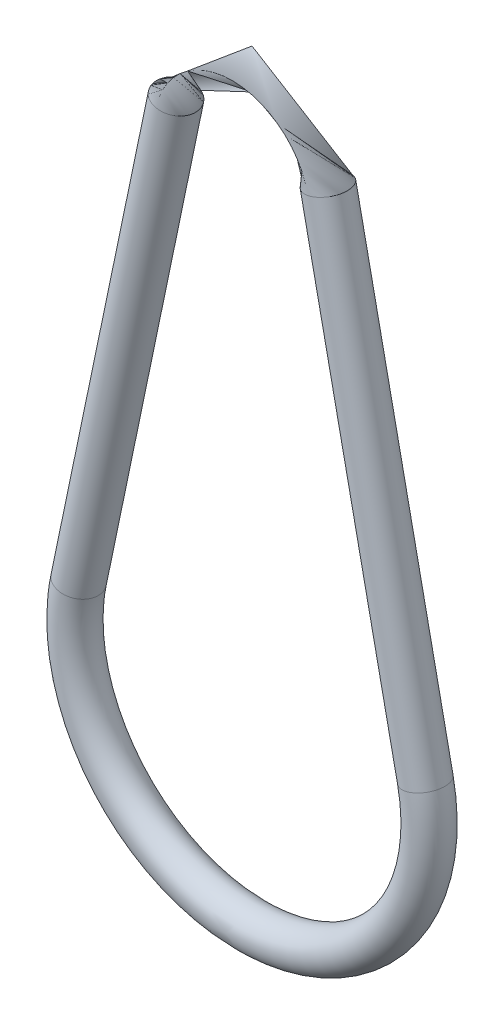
ISO-10303-21;
HEADER;
FILE_DESCRIPTION(('STEP AP214'),'2;1');
FILE_NAME('part.step','',(''),(''),'','','');
FILE_SCHEMA(('AUTOMOTIVE_DESIGN { 1 0 10303 214 1 1 1 1 }'));
ENDSEC;
DATA;
#1=APPLICATION_CONTEXT('core data for automotive mechanical design processes');
#2=APPLICATION_PROTOCOL_DEFINITION('international standard','automotive_design',2000,#1);
#3=PRODUCT_CONTEXT('',#1,'mechanical');
#4=PRODUCT('Part','Part','',(#3));
#5=PRODUCT_RELATED_PRODUCT_CATEGORY('part','',(#4));
#6=PRODUCT_DEFINITION_FORMATION('','',#4);
#7=PRODUCT_DEFINITION_CONTEXT('part definition',#1,'design');
#8=PRODUCT_DEFINITION('design','',#6,#7);
#9=PRODUCT_DEFINITION_SHAPE('','',#8);
#10=(LENGTH_UNIT() NAMED_UNIT(*) SI_UNIT(.MILLI.,.METRE.));
#11=(NAMED_UNIT(*) PLANE_ANGLE_UNIT() SI_UNIT($,.RADIAN.));
#12=(NAMED_UNIT(*) SI_UNIT($,.STERADIAN.) SOLID_ANGLE_UNIT());
#13=UNCERTAINTY_MEASURE_WITH_UNIT(LENGTH_MEASURE(1.E-05),#10,'distance_accuracy_value','');
#14=(GEOMETRIC_REPRESENTATION_CONTEXT(3) GLOBAL_UNCERTAINTY_ASSIGNED_CONTEXT((#13)) GLOBAL_UNIT_ASSIGNED_CONTEXT((#10,
#11,#12)) REPRESENTATION_CONTEXT('',''));
#15=CARTESIAN_POINT('',(0.,0.,0.));
#16=DIRECTION('',(0.,0.,1.));
#17=DIRECTION('',(1.,0.,0.));
#18=AXIS2_PLACEMENT_3D('',#15,#16,#17);
#19=CARTESIAN_POINT('',(-3.81792010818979,25.2959183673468,0.));
#20=DIRECTION('',(-0.204081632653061,-0.978953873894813,0.));
#21=DIRECTION('',(0.978953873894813,-0.204081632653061,0.));
#22=AXIS2_PLACEMENT_3D('',#19,#20,#21);
#23=CYLINDRICAL_SURFACE('',#22,1.);
#24=CARTESIAN_POINT('',(-3.81792010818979,25.2959183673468,0.));
#25=DIRECTION('',(0.204081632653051,0.978953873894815,0.));
#26=DIRECTION('',(0.,0.,1.));
#27=AXIS2_PLACEMENT_3D('',#24,#25,#26);
#28=CIRCLE('',#27,1.);
#29=CARTESIAN_POINT('',(-3.81792010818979,25.2959183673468,1.));
#30=VERTEX_POINT('',#29);
#31=EDGE_CURVE('E39',#30,#30,#28,.T.);
#32=ORIENTED_EDGE('',*,*,#31,.F.);
#33=EDGE_LOOP('',(#32));
#34=FACE_BOUND('',#33,.T.);
#35=CARTESIAN_POINT('',(-8.71268947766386,1.81632653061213,0.));
#36=DIRECTION('',(0.204081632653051,0.978953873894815,0.));
#37=DIRECTION('',(0.,0.,1.));
#38=AXIS2_PLACEMENT_3D('',#35,#36,#37);
#39=CIRCLE('',#38,1.);
#40=CARTESIAN_POINT('',(-8.71268947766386,1.81632653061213,1.));
#41=VERTEX_POINT('',#40);
#42=EDGE_CURVE('E10',#41,#41,#39,.T.);
#43=ORIENTED_EDGE('',*,*,#42,.T.);
#44=EDGE_LOOP('',(#43));
#45=FACE_BOUND('',#44,.T.);
#46=ADVANCED_FACE('F28',(#34,#45),#23,.T.);
#47=CARTESIAN_POINT('',(0.,24.5,0.));
#48=DIRECTION('',(0.,0.,1.));
#49=DIRECTION('',(1.,0.,0.));
#50=AXIS2_PLACEMENT_3D('',#47,#48,#49);
#51=TOROIDAL_SURFACE('',#50,3.9,1.);
#52=CARTESIAN_POINT('',(-0.000948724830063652,27.3999998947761,-0.000316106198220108));
#53=CARTESIAN_POINT('',(-0.000966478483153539,27.3999998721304,-0.000262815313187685));
#54=CARTESIAN_POINT('',(-0.000979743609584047,27.3999998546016,-0.000207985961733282));
#55=CARTESIAN_POINT('',(-0.000996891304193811,27.3999998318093,-9.68327202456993E-05));
#56=CARTESIAN_POINT('',(-0.00100076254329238,27.3999998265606,-4.05071083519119E-05));
#57=CARTESIAN_POINT('',(-0.000998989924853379,27.3999998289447,7.19726458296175E-05));
#58=CARTESIAN_POINT('',(-0.000993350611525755,27.3999998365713,0.000128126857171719));
#59=CARTESIAN_POINT('',(-0.000972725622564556,27.3999998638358,0.000238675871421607));
#60=CARTESIAN_POINT('',(-0.000957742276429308,27.3999998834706,0.000293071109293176));
#61=CARTESIAN_POINT('',(-0.000918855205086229,27.3999999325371,0.000398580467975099));
#62=CARTESIAN_POINT('',(-0.000894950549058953,27.3999999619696,0.000449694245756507));
#63=CARTESIAN_POINT('',(-0.000838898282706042,27.4000000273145,0.000547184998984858));
#64=CARTESIAN_POINT('',(-0.000806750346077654,27.4000000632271,0.000593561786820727));
#65=CARTESIAN_POINT('',(-0.000735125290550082,27.4000001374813,0.000680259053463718));
#66=CARTESIAN_POINT('',(-0.000695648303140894,27.4000001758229,0.000720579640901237));
#67=CARTESIAN_POINT('',(-0.000610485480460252,27.4000002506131,0.000794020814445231));
#68=CARTESIAN_POINT('',(-0.000564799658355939,27.4000002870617,0.000827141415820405));
#69=CARTESIAN_POINT('',(-0.000468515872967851,27.4000003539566,0.000885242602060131));
#70=CARTESIAN_POINT('',(-0.00041791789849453,27.4000003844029,0.000910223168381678));
#71=CARTESIAN_POINT('',(-0.000313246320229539,27.4000004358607,0.000951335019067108));
#72=CARTESIAN_POINT('',(-0.000259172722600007,27.4000004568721,0.000967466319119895));
#73=CARTESIAN_POINT('',(-0.000149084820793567,27.4000004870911,0.000990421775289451));
#74=CARTESIAN_POINT('',(-9.30705171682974E-05,27.4000004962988,0.000997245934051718));
#75=CARTESIAN_POINT('',(1.93087879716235E-05,27.4000005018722,0.00100139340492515));
#76=CARTESIAN_POINT('',(7.56737898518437E-05,27.400000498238,0.000998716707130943));
#77=CARTESIAN_POINT('',(0.00018715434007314,27.4000004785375,0.000983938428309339));
#78=CARTESIAN_POINT('',(0.000242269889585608,27.4000004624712,0.000971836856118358));
#79=CARTESIAN_POINT('',(0.000349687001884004,27.4000004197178,0.000938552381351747));
#80=CARTESIAN_POINT('',(0.000401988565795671,27.4000003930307,0.00091736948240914));
#81=CARTESIAN_POINT('',(0.000502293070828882,27.4000003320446,0.000866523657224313));
#82=CARTESIAN_POINT('',(0.000550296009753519,27.4000002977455,0.000836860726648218));
#83=CARTESIAN_POINT('',(0.000640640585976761,27.4000002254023,0.000769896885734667));
#84=CARTESIAN_POINT('',(0.000682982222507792,27.4000001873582,0.000732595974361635));
#85=CARTESIAN_POINT('',(0.000760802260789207,27.400000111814,0.000651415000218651));
#86=CARTESIAN_POINT('',(0.000796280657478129,27.400000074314,0.000607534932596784));
#87=CARTESIAN_POINT('',(0.000859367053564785,27.400000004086,0.000514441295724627));
#88=CARTESIAN_POINT('',(0.000886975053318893,27.3999999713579,0.000465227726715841));
#89=CARTESIAN_POINT('',(0.00093353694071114,27.3999999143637,0.000362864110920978));
#90=CARTESIAN_POINT('',(0.000952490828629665,27.3999998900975,0.00030971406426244));
#91=CARTESIAN_POINT('',(0.000981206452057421,27.3999998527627,0.000200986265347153));
#92=CARTESIAN_POINT('',(0.000990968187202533,27.3999998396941,0.000145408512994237));
#93=CARTESIAN_POINT('',(0.00100102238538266,27.399999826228,3.34030378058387E-05));
#94=CARTESIAN_POINT('',(0.00100131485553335,27.3999998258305,-2.30246843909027E-05));
#95=CARTESIAN_POINT('',(0.000992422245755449,27.3999998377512,-0.000135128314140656));
#96=CARTESIAN_POINT('',(0.000983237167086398,27.3999998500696,-0.00019080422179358));
#97=CARTESIAN_POINT('',(0.00095565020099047,27.3999998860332,-0.000299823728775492));
#98=CARTESIAN_POINT('',(0.000937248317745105,27.3999999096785,-0.000353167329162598));
#99=CARTESIAN_POINT('',(0.000891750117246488,27.3999999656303,-0.000456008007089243));
#100=CARTESIAN_POINT('',(0.000864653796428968,27.3999999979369,-0.000505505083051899));
#101=CARTESIAN_POINT('',(0.000802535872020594,27.4000000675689,-0.000599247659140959));
#102=CARTESIAN_POINT('',(0.000767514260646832,27.4000001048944,-0.000643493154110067));
#103=CARTESIAN_POINT('',(0.00069053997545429,27.400000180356,-0.000725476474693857));
#104=CARTESIAN_POINT('',(0.000648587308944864,27.4000002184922,-0.000763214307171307));
#105=CARTESIAN_POINT('',(0.000558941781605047,27.4000002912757,-0.000831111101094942));
#106=CARTESIAN_POINT('',(0.000511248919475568,27.4000003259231,-0.000861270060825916));
#107=CARTESIAN_POINT('',(0.000411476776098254,27.4000003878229,-0.000913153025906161));
#108=CARTESIAN_POINT('',(0.000359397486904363,27.4000004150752,-0.000934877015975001));
#109=CARTESIAN_POINT('',(0.000252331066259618,27.4000004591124,-0.00096927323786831));
#110=CARTESIAN_POINT('',(0.000197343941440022,27.4000004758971,-0.00098194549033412));
#111=CARTESIAN_POINT('',(8.60225499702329E-05,27.4000004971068,-0.000997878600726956));
#112=CARTESIAN_POINT('',(2.9688280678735E-05,27.4000005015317,-0.00100113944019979));
#113=CARTESIAN_POINT('',(-8.27291153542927E-05,27.4000004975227,-0.000998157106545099));
#114=CARTESIAN_POINT('',(-0.000138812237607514,27.4000004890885,-0.000991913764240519));
#115=CARTESIAN_POINT('',(-0.000249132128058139,27.4000004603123,-0.000970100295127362));
#116=CARTESIAN_POINT('',(-0.000303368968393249,27.4000004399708,-0.0009545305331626));
#117=CARTESIAN_POINT('',(-0.000408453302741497,27.4000003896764,-0.000914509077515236));
#118=CARTESIAN_POINT('',(-0.000459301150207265,27.4000003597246,-0.000890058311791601));
#119=CARTESIAN_POINT('',(-0.000556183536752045,27.400000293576,-0.000832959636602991));
#120=CARTESIAN_POINT('',(-0.000602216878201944,27.4000002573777,-0.000800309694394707));
#121=CARTESIAN_POINT('',(-0.00068816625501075,27.4000001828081,-0.000727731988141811));
#122=CARTESIAN_POINT('',(-0.000728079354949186,27.4000001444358,-0.000687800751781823));
#123=CARTESIAN_POINT('',(-0.00080059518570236,27.4000000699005,-0.00060183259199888));
#124=CARTESIAN_POINT('',(-0.00083320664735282,27.4000000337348,-0.000555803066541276));
#125=CARTESIAN_POINT('',(-0.0008795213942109,27.399999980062,-0.000477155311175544));
#126=CARTESIAN_POINT('',(-0.00089572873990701,27.3999999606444,-0.000445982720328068));
#127=CARTESIAN_POINT('',(-0.000924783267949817,27.3999999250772,-0.000382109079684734));
#128=CARTESIAN_POINT('',(-0.000937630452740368,27.3999999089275,-0.00034940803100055));
#129=CARTESIAN_POINT('',(-0.000948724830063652,27.3999998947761,-0.000316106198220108));
#130=B_SPLINE_CURVE_WITH_KNOTS('',3,(#52,#53,#54,#55,#56,#57,#58,#59,#60,#61,#62,#63,#64,#65,
#66,#67,#68,#69,#70,#71,#72,#73,#74,#75,#76,#77,#78,#79,#80,#81,#82,#83,#84,#85,#86,#87,#88,#89,
#90,#91,#92,#93,#94,#95,#96,#97,#98,#99,#100,#101,#102,#103,#104,#105,#106,#107,#108,#109,#110,
#111,#112,#113,#114,#115,#116,#117,#118,#119,#120,#121,#122,#123,#124,#125,#126,#127,#128,#129),
.UNSPECIFIED.,.T.,.F.,(4,2,2,2,2,2,2,2,2,2,2,2,2,2,2,2,2,2,2,2,2,2,2,2,2,2,2,2,2,2,2,2,2,2,2,2,
2,2,4),(0.,0.000168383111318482,0.000336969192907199,0.000505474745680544,0.000673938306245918,
0.000842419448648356,0.00101090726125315,0.0011793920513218,0.00134787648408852,
0.00151636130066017,0.00168484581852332,0.00185333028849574,0.00202181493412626,
0.00219029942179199,0.00235878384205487,0.00252726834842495,0.00269575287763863,
0.00286423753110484,0.00303272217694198,0.00320120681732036,0.00336969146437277,
0.00353817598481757,0.00370666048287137,0.00387514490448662,0.00404362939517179,
0.00421211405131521,0.00438059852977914,0.00454908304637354,0.00471756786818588,
0.00488605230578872,0.00505453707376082,0.00522302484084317,0.00539150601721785,
0.00555996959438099,0.00572847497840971,0.00589706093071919,0.00606544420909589,
0.00617066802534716,0.00627589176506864),.UNSPECIFIED.);
#131=CARTESIAN_POINT('',(-0.000948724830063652,27.3999998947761,-0.000316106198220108));
#132=VERTEX_POINT('',#131);
#133=EDGE_CURVE('E68',#132,#132,#130,.T.);
#134=ORIENTED_EDGE('',*,*,#133,.T.);
#135=EDGE_LOOP('',(#134));
#136=FACE_BOUND('',#135,.T.);
#137=CARTESIAN_POINT('',(-0.000947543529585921,29.3999986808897,-0.00031592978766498));
#138=CARTESIAN_POINT('',(-0.000929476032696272,29.3999983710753,-0.000369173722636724));
#139=CARTESIAN_POINT('',(-0.000908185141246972,29.399999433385,-0.000421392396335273));
#140=CARTESIAN_POINT('',(-0.000855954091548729,29.4000001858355,-0.000520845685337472));
#141=CARTESIAN_POINT('',(-0.000825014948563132,29.3999998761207,-0.000568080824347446));
#142=CARTESIAN_POINT('',(-0.000755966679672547,29.3999996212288,-0.000656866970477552));
#143=CARTESIAN_POINT('',(-0.000717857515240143,29.3999996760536,-0.000698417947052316));
#144=CARTESIAN_POINT('',(-0.000635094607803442,29.3999996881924,-0.000774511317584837));
#145=CARTESIAN_POINT('',(-0.000590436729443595,29.3999996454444,-0.000809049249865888));
#146=CARTESIAN_POINT('',(-0.000495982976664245,29.3999995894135,-0.000870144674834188));
#147=CARTESIAN_POINT('',(-0.000446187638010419,29.3999995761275,-0.000896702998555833));
#148=CARTESIAN_POINT('',(-0.000342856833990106,29.3999995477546,-0.000941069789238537));
#149=CARTESIAN_POINT('',(-0.000289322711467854,29.3999995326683,-0.000958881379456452));
#150=CARTESIAN_POINT('',(-0.000180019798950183,29.3999995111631,-0.00098526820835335));
#151=CARTESIAN_POINT('',(-0.000124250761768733,29.3999995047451,-0.000993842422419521));
#152=CARTESIAN_POINT('',(-1.20567006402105E-05,29.3999994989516,-0.00100150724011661));
#153=CARTESIAN_POINT('',(4.43684109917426E-05,29.3999994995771,-0.00100059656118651));
#154=CARTESIAN_POINT('',(0.000156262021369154,29.3999995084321,-0.000989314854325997));
#155=CARTESIAN_POINT('',(0.000211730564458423,29.3999995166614,-0.000978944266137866));
#156=CARTESIAN_POINT('',(0.000320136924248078,29.3999995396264,-0.000949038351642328));
#157=CARTESIAN_POINT('',(0.000373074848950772,29.3999995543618,-0.000929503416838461));
#158=CARTESIAN_POINT('',(0.000474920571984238,29.3999995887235,-0.000881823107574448));
#159=CARTESIAN_POINT('',(0.000523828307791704,29.3999996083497,-0.00085367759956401));
#160=CARTESIAN_POINT('',(0.000616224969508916,29.3999996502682,-0.000789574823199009));
#161=CARTESIAN_POINT('',(0.000659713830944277,29.3999996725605,-0.000753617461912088));
#162=CARTESIAN_POINT('',(0.0007400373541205,29.3999997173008,-0.000674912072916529));
#163=CARTESIAN_POINT('',(0.000776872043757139,29.3999997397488,-0.000632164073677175));
#164=CARTESIAN_POINT('',(0.000842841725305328,29.3999997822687,-0.000541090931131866));
#165=CARTESIAN_POINT('',(0.000871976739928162,29.3999998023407,-0.000492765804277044));
#166=CARTESIAN_POINT('',(0.000921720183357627,29.399999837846,-0.000391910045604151));
#167=CARTESIAN_POINT('',(0.000942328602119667,29.3999998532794,-0.000339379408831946));
#168=CARTESIAN_POINT('',(0.000974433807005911,29.3999998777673,-0.000231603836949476));
#169=CARTESIAN_POINT('',(0.000985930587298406,29.3999998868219,-0.000176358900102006));
#170=CARTESIAN_POINT('',(0.00099948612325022,29.3999998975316,-6.47230308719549E-05));
#171=CARTESIAN_POINT('',(0.00100154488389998,29.3999998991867,-8.33209909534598E-06));
#172=CARTESIAN_POINT('',(0.000996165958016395,29.3999998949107,0.000103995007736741));
#173=CARTESIAN_POINT('',(0.000988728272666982,29.3999998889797,0.000159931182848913));
#174=CARTESIAN_POINT('',(0.000964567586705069,29.3999998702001,0.000269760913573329));
#175=CARTESIAN_POINT('',(0.000947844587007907,29.3999998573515,0.000323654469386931));
#176=CARTESIAN_POINT('',(0.000905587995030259,29.3999998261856,0.00042786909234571));
#177=CARTESIAN_POINT('',(0.000880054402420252,29.3999998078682,0.000478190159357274));
#178=CARTESIAN_POINT('',(0.000820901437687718,29.3999997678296,0.000573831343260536));
#179=CARTESIAN_POINT('',(0.00078728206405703,29.3999997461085,0.000619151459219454));
#180=CARTESIAN_POINT('',(0.000712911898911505,29.3999997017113,0.000703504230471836));
#181=CARTESIAN_POINT('',(0.000672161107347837,29.3999996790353,0.000742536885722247));
#182=CARTESIAN_POINT('',(0.000584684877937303,29.399999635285,0.000813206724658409));
#183=CARTESIAN_POINT('',(0.000537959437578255,29.3999996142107,0.000844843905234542));
#184=CARTESIAN_POINT('',(0.000439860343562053,29.3999995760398,0.000899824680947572));
#185=CARTESIAN_POINT('',(0.000388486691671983,29.3999995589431,0.000923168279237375));
#186=CARTESIAN_POINT('',(0.000282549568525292,29.3999995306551,0.000960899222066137));
#187=CARTESIAN_POINT('',(0.000227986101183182,29.3999995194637,0.000975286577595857));
#188=CARTESIAN_POINT('',(0.000117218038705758,29.3999995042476,0.000994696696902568));
#189=CARTESIAN_POINT('',(6.10134392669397E-05,29.3999995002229,0.000999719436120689));
#190=CARTESIAN_POINT('',(-5.14415472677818E-05,29.3999994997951,0.001000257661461));
#191=CARTESIAN_POINT('',(-0.000107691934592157,29.399999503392,0.000995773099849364));
#192=CARTESIAN_POINT('',(-0.000218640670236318,29.3999995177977,0.000977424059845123));
#193=CARTESIAN_POINT('',(-0.000273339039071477,29.3999995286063,0.000963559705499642));
#194=CARTESIAN_POINT('',(-0.000379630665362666,29.3999995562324,0.00092684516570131));
#195=CARTESIAN_POINT('',(-0.000431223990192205,29.3999995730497,0.000903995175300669));
#196=CARTESIAN_POINT('',(-0.000529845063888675,29.3999996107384,0.000849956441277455));
#197=CARTESIAN_POINT('',(-0.000576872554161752,29.3999996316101,0.0008187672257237));
#198=CARTESIAN_POINT('',(-0.000665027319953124,29.3999996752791,0.000748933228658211));
#199=CARTESIAN_POINT('',(-0.000706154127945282,29.3999996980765,0.00071028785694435));
#200=CARTESIAN_POINT('',(-0.000781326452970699,29.3999997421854,0.00062664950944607));
#201=CARTESIAN_POINT('',(-0.000815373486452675,29.3999997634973,0.000581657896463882));
#202=CARTESIAN_POINT('',(-0.000875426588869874,29.3999998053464,0.000486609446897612));
#203=CARTESIAN_POINT('',(-0.000901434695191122,29.3999998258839,0.000436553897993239));
#204=CARTESIAN_POINT('',(-0.000944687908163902,29.3999998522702,0.000332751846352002));
#205=CARTESIAN_POINT('',(-0.000961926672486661,29.3999998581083,0.000279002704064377));
#206=CARTESIAN_POINT('',(-0.000987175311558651,29.3999998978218,0.000169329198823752));
#207=CARTESIAN_POINT('',(-0.000995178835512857,29.3999999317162,0.000113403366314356));
#208=CARTESIAN_POINT('',(-0.00100153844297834,29.3999998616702,1.14109181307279E-06));
#209=CARTESIAN_POINT('',(-0.000999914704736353,29.3999997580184,-5.51942443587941E-05));
#210=CARTESIAN_POINT('',(-0.000990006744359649,29.3999999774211,-0.000145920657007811));
#211=CARTESIAN_POINT('',(-0.000984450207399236,29.400000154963,-0.000180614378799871));
#212=CARTESIAN_POINT('',(-0.000968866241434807,29.3999996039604,-0.000248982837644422));
#213=CARTESIAN_POINT('',(-0.000958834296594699,29.3999988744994,-0.000282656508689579));
#214=CARTESIAN_POINT('',(-0.000947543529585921,29.3999986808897,-0.00031592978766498));
#215=B_SPLINE_CURVE_WITH_KNOTS('',3,(#137,#138,#139,#140,#141,#142,#143,#144,#145,#146,#147,
#148,#149,#150,#151,#152,#153,#154,#155,#156,#157,#158,#159,#160,#161,#162,#163,#164,#165,#166,
#167,#168,#169,#170,#171,#172,#173,#174,#175,#176,#177,#178,#179,#180,#181,#182,#183,#184,#185,
#186,#187,#188,#189,#190,#191,#192,#193,#194,#195,#196,#197,#198,#199,#200,#201,#202,#203,#204,
#205,#206,#207,#208,#209,#210,#211,#212,#213,#214),.UNSPECIFIED.,.T.,.F.,(4,2,2,2,2,2,2,2,2,2,2,
2,2,2,2,2,2,2,2,2,2,2,2,2,2,2,2,2,2,2,2,2,2,2,2,2,2,2,4),(0.,0.000168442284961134,
0.000336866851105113,0.000505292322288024,0.000673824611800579,0.000842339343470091,
0.001010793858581,0.00117926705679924,0.0013477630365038,0.00151625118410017,
0.00168473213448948,0.00185321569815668,0.00202170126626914,0.00219018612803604,
0.00235867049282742,0.002527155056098,0.00269563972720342,0.00286412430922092,
0.00303260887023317,0.00320109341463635,0.00336957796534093,0.00353806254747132,
0.00370654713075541,0.00387503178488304,0.00404351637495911,0.00421200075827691,
0.00438048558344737,0.00454897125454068,0.00471745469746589,0.00488593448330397,
0.00505442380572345,0.00522292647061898,0.00539139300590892,0.00555981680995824,
0.0057283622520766,0.0058970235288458,0.0060653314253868,0.00617048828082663,
0.00627575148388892),.UNSPECIFIED.);
#216=CARTESIAN_POINT('',(-0.000947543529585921,29.3999986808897,-0.00031592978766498));
#217=VERTEX_POINT('',#216);
#218=EDGE_CURVE('E64',#217,#217,#215,.T.);
#219=ORIENTED_EDGE('',*,*,#218,.T.);
#220=EDGE_LOOP('',(#219));
#221=FACE_BOUND('',#220,.T.);
#222=CARTESIAN_POINT('',(3.81792010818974,25.2959183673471,0.));
#223=DIRECTION('',(0.204081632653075,-0.97895387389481,0.));
#224=DIRECTION('',(0.,0.,1.));
#225=AXIS2_PLACEMENT_3D('',#222,#223,#224);
#226=CIRCLE('',#225,1.);
#227=CARTESIAN_POINT('',(2.83896623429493,25.091836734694,0.));
#228=VERTEX_POINT('',#227);
#229=EDGE_CURVE('E44',#228,#228,#226,.T.);
#230=ORIENTED_EDGE('',*,*,#229,.F.);
#231=EDGE_LOOP('',(#230));
#232=FACE_BOUND('',#231,.T.);
#233=ORIENTED_EDGE('',*,*,#31,.T.);
#234=EDGE_LOOP('',(#233));
#235=FACE_BOUND('',#234,.T.);
#236=ADVANCED_FACE('F72',(#136,#221,#232,#235),#51,.T.);
#237=CARTESIAN_POINT('',(8.71268947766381,1.81632653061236,0.));
#238=DIRECTION('',(-0.204081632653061,0.978953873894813,0.));
#239=DIRECTION('',(-0.978953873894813,-0.204081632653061,0.));
#240=AXIS2_PLACEMENT_3D('',#237,#238,#239);
#241=CYLINDRICAL_SURFACE('',#240,1.);
#242=CARTESIAN_POINT('',(8.71268947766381,1.81632653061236,0.));
#243=DIRECTION('',(0.204081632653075,-0.97895387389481,0.));
#244=DIRECTION('',(0.,0.,1.));
#245=AXIS2_PLACEMENT_3D('',#242,#243,#244);
#246=CIRCLE('',#245,1.);
#247=CARTESIAN_POINT('',(7.733735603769,1.61224489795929,0.));
#248=VERTEX_POINT('',#247);
#249=EDGE_CURVE('E127',#248,#248,#246,.T.);
#250=CARTESIAN_POINT('',(7.733735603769,1.61224489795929,0.));
#251=CARTESIAN_POINT('',(7.68274842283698,1.85682397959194,0.));
#252=CARTESIAN_POINT('',(7.63176124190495,2.1014030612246,0.));
#253=CARTESIAN_POINT('',(7.52978688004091,2.5905612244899,0.));
#254=CARTESIAN_POINT('',(7.47879969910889,2.83514030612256,0.));
#255=CARTESIAN_POINT('',(7.37682533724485,3.32429846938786,0.));
#256=CARTESIAN_POINT('',(7.32583815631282,3.56887755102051,0.));
#257=CARTESIAN_POINT('',(7.22386379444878,4.05803571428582,0.));
#258=CARTESIAN_POINT('',(7.17287661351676,4.30261479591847,0.));
#259=CARTESIAN_POINT('',(7.07090225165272,4.79177295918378,0.));
#260=CARTESIAN_POINT('',(7.0199150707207,5.03635204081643,0.));
#261=CARTESIAN_POINT('',(6.91794070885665,5.52551020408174,0.));
#262=CARTESIAN_POINT('',(6.86695352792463,5.77008928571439,0.));
#263=CARTESIAN_POINT('',(6.76497916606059,6.2592474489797,0.));
#264=CARTESIAN_POINT('',(6.71399198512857,6.50382653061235,0.));
#265=CARTESIAN_POINT('',(6.61201762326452,6.99298469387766,0.));
#266=CARTESIAN_POINT('',(6.5610304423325,7.23756377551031,0.));
#267=CARTESIAN_POINT('',(6.45905608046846,7.72672193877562,0.));
#268=CARTESIAN_POINT('',(6.40806889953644,7.97130102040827,0.));
#269=CARTESIAN_POINT('',(6.30609453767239,8.46045918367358,0.));
#270=CARTESIAN_POINT('',(6.25510735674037,8.70503826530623,0.));
#271=CARTESIAN_POINT('',(6.15313299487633,9.19419642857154,0.));
#272=CARTESIAN_POINT('',(6.10214581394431,9.43877551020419,0.));
#273=CARTESIAN_POINT('',(6.00017145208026,9.9279336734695,0.));
#274=CARTESIAN_POINT('',(5.94918427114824,10.1725127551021,0.));
#275=CARTESIAN_POINT('',(5.8472099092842,10.6616709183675,0.));
#276=CARTESIAN_POINT('',(5.79622272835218,10.9062500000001,0.));
#277=CARTESIAN_POINT('',(5.69424836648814,11.3954081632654,0.));
#278=CARTESIAN_POINT('',(5.64326118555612,11.6399872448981,0.));
#279=CARTESIAN_POINT('',(5.54128682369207,12.1291454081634,0.));
#280=CARTESIAN_POINT('',(5.49029964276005,12.373724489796,0.));
#281=CARTESIAN_POINT('',(5.38832528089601,12.8628826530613,0.));
#282=CARTESIAN_POINT('',(5.33733809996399,13.107461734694,0.));
#283=CARTESIAN_POINT('',(5.23536373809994,13.5966198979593,0.));
#284=CARTESIAN_POINT('',(5.18437655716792,13.8411989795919,0.));
#285=CARTESIAN_POINT('',(5.08240219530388,14.3303571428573,0.));
#286=CARTESIAN_POINT('',(5.03141501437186,14.5749362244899,0.));
#287=CARTESIAN_POINT('',(4.92944065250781,15.0640943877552,0.));
#288=CARTESIAN_POINT('',(4.87845347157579,15.3086734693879,0.));
#289=CARTESIAN_POINT('',(4.77647910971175,15.7978316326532,0.));
#290=CARTESIAN_POINT('',(4.72549192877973,16.0424107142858,0.));
#291=CARTESIAN_POINT('',(4.62351756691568,16.5315688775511,0.));
#292=CARTESIAN_POINT('',(4.57253038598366,16.7761479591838,0.));
#293=CARTESIAN_POINT('',(4.47055602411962,17.2653061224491,0.));
#294=CARTESIAN_POINT('',(4.4195688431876,17.5098852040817,0.));
#295=CARTESIAN_POINT('',(4.31759448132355,17.9990433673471,0.));
#296=CARTESIAN_POINT('',(4.26660730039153,18.2436224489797,0.));
#297=CARTESIAN_POINT('',(4.16463293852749,18.732780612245,0.));
#298=CARTESIAN_POINT('',(4.11364575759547,18.9773596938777,0.));
#299=CARTESIAN_POINT('',(4.01167139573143,19.466517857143,0.));
#300=CARTESIAN_POINT('',(3.9606842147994,19.7110969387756,0.));
#301=CARTESIAN_POINT('',(3.85870985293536,20.2002551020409,0.));
#302=CARTESIAN_POINT('',(3.80772267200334,20.4448341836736,0.));
#303=CARTESIAN_POINT('',(3.7057483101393,20.9339923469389,0.));
#304=CARTESIAN_POINT('',(3.65476112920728,21.1785714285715,0.));
#305=CARTESIAN_POINT('',(3.55278676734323,21.6677295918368,0.));
#306=CARTESIAN_POINT('',(3.50179958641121,21.9123086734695,0.));
#307=CARTESIAN_POINT('',(3.39982522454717,22.4014668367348,0.));
#308=CARTESIAN_POINT('',(3.34883804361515,22.6460459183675,0.));
#309=CARTESIAN_POINT('',(3.2468636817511,23.1352040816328,0.));
#310=CARTESIAN_POINT('',(3.19587650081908,23.3797831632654,0.));
#311=CARTESIAN_POINT('',(3.09390213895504,23.8689413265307,0.));
#312=CARTESIAN_POINT('',(3.04291495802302,24.1135204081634,0.));
#313=CARTESIAN_POINT('',(2.94094059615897,24.6026785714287,0.));
#314=CARTESIAN_POINT('',(2.88995341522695,24.8472576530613,0.));
#315=CARTESIAN_POINT('',(2.83896623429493,25.091836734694,0.));
#316=B_SPLINE_CURVE_WITH_KNOTS('',3,(#250,#251,#252,#253,#254,#255,#256,#257,#258,#259,#260,
#261,#262,#263,#264,#265,#266,#267,#268,#269,#270,#271,#272,#273,#274,#275,#276,#277,#278,#279,
#280,#281,#282,#283,#284,#285,#286,#287,#288,#289,#290,#291,#292,#293,#294,#295,#296,#297,#298,
#299,#300,#301,#302,#303,#304,#305,#306,#307,#308,#309,#310,#311,#312,#313,#314,#315),
.UNSPECIFIED.,.F.,.F.,(4,2,2,2,2,2,2,2,2,2,2,2,2,2,2,2,2,2,2,2,2,2,2,2,2,2,2,2,2,2,2,2,4),(0.,
0.749511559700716,1.49902311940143,2.24853467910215,2.99804623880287,3.74755779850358,
4.4970693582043,5.24658091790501,5.99609247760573,6.74560403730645,7.49511559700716,
8.24462715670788,8.9941387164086,9.74365027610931,10.49316183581,11.2426733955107,
11.9921849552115,12.7416965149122,13.4912080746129,14.2407196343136,14.9902311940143,
15.739742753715,16.4892543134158,17.2387658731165,17.9882774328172,18.7377889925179,
19.4873005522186,20.2368121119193,20.9863236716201,21.7358352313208,22.4853467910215,
23.2348583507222,23.9843699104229),.UNSPECIFIED.);
#317=EDGE_CURVE('BSEAM75',#248,#228,#316,.T.);
#318=ORIENTED_EDGE('',*,*,#249,.F.);
#319=ORIENTED_EDGE('',*,*,#229,.T.);
#320=ORIENTED_EDGE('',*,*,#317,.T.);
#321=ORIENTED_EDGE('',*,*,#317,.F.);
#322=EDGE_LOOP('',(#318,#320,#319,#321));
#323=FACE_BOUND('',#322,.T.);
#324=ADVANCED_FACE('F75',(#323),#241,.T.);
#325=CARTESIAN_POINT('',(0.,0.,0.));
#326=DIRECTION('',(0.,0.,-1.));
#327=DIRECTION('',(-1.,0.,0.));
#328=AXIS2_PLACEMENT_3D('',#325,#326,#327);
#329=TOROIDAL_SURFACE('',#328,8.9,1.);
#330=CARTESIAN_POINT('',(-0.000948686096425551,-9.8999999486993,-0.000316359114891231));
#331=CARTESIAN_POINT('',(-0.000930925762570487,-9.89999994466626,-0.000369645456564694));
#332=CARTESIAN_POINT('',(-0.000908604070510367,-9.89999988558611,-0.000421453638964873));
#333=CARTESIAN_POINT('',(-0.000855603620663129,-9.89999981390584,-0.000520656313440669));
#334=CARTESIAN_POINT('',(-0.000824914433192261,-9.89999980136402,-0.000568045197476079));
#335=CARTESIAN_POINT('',(-0.0007560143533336,-9.89999976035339,-0.000656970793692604));
#336=CARTESIAN_POINT('',(-0.000717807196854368,-9.89999973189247,-0.000698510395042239));
#337=CARTESIAN_POINT('',(-0.000634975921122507,-9.89999967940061,-0.00077457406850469));
#338=CARTESIAN_POINT('',(-0.000590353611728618,-9.89999965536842,-0.000809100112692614));
#339=CARTESIAN_POINT('',(-0.000495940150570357,-9.89999960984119,-0.00087017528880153));
#340=CARTESIAN_POINT('',(-0.000446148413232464,-9.89999958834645,-0.000896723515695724));
#341=CARTESIAN_POINT('',(-0.000342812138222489,-9.8999995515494,-0.000941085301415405));
#342=CARTESIAN_POINT('',(-0.00028926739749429,-9.89999953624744,-0.000958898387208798));
#343=CARTESIAN_POINT('',(-0.00017994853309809,-9.89999951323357,-0.000985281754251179));
#344=CARTESIAN_POINT('',(-0.000124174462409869,-9.89999950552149,-0.000993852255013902));
#345=CARTESIAN_POINT('',(-1.19795089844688E-05,-9.89999949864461,-0.00100150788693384));
#346=CARTESIAN_POINT('',(4.4441369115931E-05,-9.89999949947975,-0.00100059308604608));
#347=CARTESIAN_POINT('',(0.00015632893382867,-9.89999950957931,-0.000989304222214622));
#348=CARTESIAN_POINT('',(0.000211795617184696,-9.89999951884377,-0.000978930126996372));
#349=CARTESIAN_POINT('',(0.000320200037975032,-9.89999954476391,-0.000949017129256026));
#350=CARTESIAN_POINT('',(0.000373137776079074,-9.89999956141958,-0.000929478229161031));
#351=CARTESIAN_POINT('',(0.000474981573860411,-9.89999960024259,-0.000881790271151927));
#352=CARTESIAN_POINT('',(0.000523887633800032,-9.89999962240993,-0.000853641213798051));
#353=CARTESIAN_POINT('',(0.000616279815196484,-9.89999966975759,-0.000789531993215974));
#354=CARTESIAN_POINT('',(0.000659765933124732,-9.89999969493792,-0.000753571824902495));
#355=CARTESIAN_POINT('',(0.000740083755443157,-9.8999997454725,-0.000674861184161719));
#356=CARTESIAN_POINT('',(0.000776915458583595,-9.89999977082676,-0.000632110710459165));
#357=CARTESIAN_POINT('',(0.00084287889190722,-9.89999981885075,-0.000541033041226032));
#358=CARTESIAN_POINT('',(0.000872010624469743,-9.89999984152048,-0.000492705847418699));
#359=CARTESIAN_POINT('',(0.000921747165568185,-9.89999988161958,-0.000391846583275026));
#360=CARTESIAN_POINT('',(0.000942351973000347,-9.89999989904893,-0.000339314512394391));
#361=CARTESIAN_POINT('',(0.000974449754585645,-9.89999992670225,-0.000231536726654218));
#362=CARTESIAN_POINT('',(0.000985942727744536,-9.89999993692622,-0.000176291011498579));
#363=CARTESIAN_POINT('',(0.000999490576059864,-9.89999994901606,-6.46542273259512E-05));
#364=CARTESIAN_POINT('',(0.00100154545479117,-9.89999995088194,-8.26315874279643E-06));
#365=CARTESIAN_POINT('',(0.00099615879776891,-9.89999994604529,0.000104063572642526));
#366=CARTESIAN_POINT('',(0.000988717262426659,-9.89999993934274,0.000159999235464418));
#367=CARTESIAN_POINT('',(0.000964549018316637,-9.89999991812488,0.000269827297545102));
#368=CARTESIAN_POINT('',(0.000947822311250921,-9.89999990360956,0.000323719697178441));
#369=CARTESIAN_POINT('',(0.000905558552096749,-9.89999986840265,0.000427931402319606));
#370=CARTESIAN_POINT('',(0.000880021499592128,-9.89999984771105,0.000478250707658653));
#371=CARTESIAN_POINT('',(0.000820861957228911,-9.89999980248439,0.000573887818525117));
#372=CARTESIAN_POINT('',(0.000787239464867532,-9.89999977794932,0.000619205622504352));
#373=CARTESIAN_POINT('',(0.000712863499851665,-9.89999972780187,0.0007035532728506));
#374=CARTESIAN_POINT('',(0.000672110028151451,-9.89999970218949,0.000742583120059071));
#375=CARTESIAN_POINT('',(0.000584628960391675,-9.89999965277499,0.000813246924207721));
#376=CARTESIAN_POINT('',(0.000537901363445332,-9.89999962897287,0.000844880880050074));
#377=CARTESIAN_POINT('',(0.000439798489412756,-9.89999958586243,0.00089985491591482));
#378=CARTESIAN_POINT('',(0.000388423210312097,-9.8999995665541,0.000923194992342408));
#379=CARTESIAN_POINT('',(0.000282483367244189,-9.89999953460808,0.00096091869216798));
#380=CARTESIAN_POINT('',(0.000227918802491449,-9.89999952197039,0.000975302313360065));
#381=CARTESIAN_POINT('',(0.000117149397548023,-9.89999950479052,0.00099470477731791));
#382=CARTESIAN_POINT('',(6.09445593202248E-05,-9.89999950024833,0.000999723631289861));
#383=CARTESIAN_POINT('',(-5.15099127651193E-05,-9.89999949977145,0.00100025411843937));
#384=CARTESIAN_POINT('',(-0.000107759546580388,-9.89999950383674,0.000995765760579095));
#385=CARTESIAN_POINT('',(-0.00021870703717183,-9.89999952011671,0.000977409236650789));
#386=CARTESIAN_POINT('',(-0.000273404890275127,-9.89999953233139,0.000963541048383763));
#387=CARTESIAN_POINT('',(-0.000379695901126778,-9.89999956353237,0.000926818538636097));
#388=CARTESIAN_POINT('',(-0.000431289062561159,-9.89999958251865,0.000903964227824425));
#389=CARTESIAN_POINT('',(-0.000529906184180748,-9.89999962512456,0.000849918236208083));
#390=CARTESIAN_POINT('',(-0.000576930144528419,-9.89999964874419,0.000818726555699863));
#391=CARTESIAN_POINT('',(-0.000665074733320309,-9.89999969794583,0.000748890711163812));
#392=CARTESIAN_POINT('',(-0.000706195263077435,-9.89999972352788,0.000710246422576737));
#393=CARTESIAN_POINT('',(-0.000781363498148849,-9.89999977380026,0.000626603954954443));
#394=CARTESIAN_POINT('',(-0.000815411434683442,-9.89999979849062,0.000581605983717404));
#395=CARTESIAN_POINT('',(-0.000875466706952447,-9.89999984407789,0.00048653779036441));
#396=CARTESIAN_POINT('',(-0.000901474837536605,-9.89999986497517,0.000436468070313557));
#397=CARTESIAN_POINT('',(-0.000944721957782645,-9.89999990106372,0.000332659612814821));
#398=CARTESIAN_POINT('',(-0.000961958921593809,-9.89999991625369,0.000278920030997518));
#399=CARTESIAN_POINT('',(-0.000987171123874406,-9.89999993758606,0.000169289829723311));
#400=CARTESIAN_POINT('',(-0.000995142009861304,-9.89999994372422,0.000113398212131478));
#401=CARTESIAN_POINT('',(-0.00100157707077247,-9.89999995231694,1.11344284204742E-06));
#402=CARTESIAN_POINT('',(-0.00100005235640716,-9.89999995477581,-5.52790456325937E-05));
#403=CARTESIAN_POINT('',(-0.000989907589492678,-9.89999993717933,-0.000145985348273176));
#404=CARTESIAN_POINT('',(-0.000984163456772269,-9.89999992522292,-0.000180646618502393));
#405=CARTESIAN_POINT('',(-0.000969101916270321,-9.89999993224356,-0.000249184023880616));
#406=CARTESIAN_POINT('',(-0.000959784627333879,-9.89999995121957,-0.000283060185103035));
#407=CARTESIAN_POINT('',(-0.000948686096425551,-9.8999999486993,-0.000316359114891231));
#408=B_SPLINE_CURVE_WITH_KNOTS('',3,(#330,#331,#332,#333,#334,#335,#336,#337,#338,#339,#340,
#341,#342,#343,#344,#345,#346,#347,#348,#349,#350,#351,#352,#353,#354,#355,#356,#357,#358,#359,
#360,#361,#362,#363,#364,#365,#366,#367,#368,#369,#370,#371,#372,#373,#374,#375,#376,#377,#378,
#379,#380,#381,#382,#383,#384,#385,#386,#387,#388,#389,#390,#391,#392,#393,#394,#395,#396,#397,
#398,#399,#400,#401,#402,#403,#404,#405,#406,#407),.UNSPECIFIED.,.T.,.F.,(4,2,2,2,2,2,2,2,2,2,2,
2,2,2,2,2,2,2,2,2,2,2,2,2,2,2,2,2,2,2,2,2,2,2,2,2,2,2,4),(0.,0.000168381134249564,
0.000336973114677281,0.000505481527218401,0.000673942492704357,0.000842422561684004,
0.00101091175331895,0.00117939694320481,0.00134788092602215,0.00151636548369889,
0.00168484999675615,0.00185333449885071,0.00202181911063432,0.00219030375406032,
0.00235878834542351,0.00252727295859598,0.0026957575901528,0.00286424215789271,
0.0030327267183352,0.00320121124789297,0.00336969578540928,0.0035381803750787,
0.00370666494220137,0.00387514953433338,0.00404363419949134,0.00421211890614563,
0.00438060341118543,0.00454908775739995,0.00471757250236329,0.00488605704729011,
0.00505454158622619,0.0052230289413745,0.00539151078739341,0.00555997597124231,
0.0057284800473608,0.00589706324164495,0.00606544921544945,0.00617067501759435,
0.00627589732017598),.UNSPECIFIED.);
#409=CARTESIAN_POINT('',(-0.000948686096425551,-9.8999999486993,-0.000316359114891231));
#410=VERTEX_POINT('',#409);
#411=EDGE_CURVE('E31',#410,#410,#408,.T.);
#412=ORIENTED_EDGE('',*,*,#411,.F.);
#413=EDGE_LOOP('',(#412));
#414=FACE_BOUND('',#413,.T.);
#415=CARTESIAN_POINT('',(-0.000948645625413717,-7.89999999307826,-0.000316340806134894));
#416=CARTESIAN_POINT('',(-0.0009664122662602,-7.89999997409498,-0.000263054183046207));
#417=CARTESIAN_POINT('',(-0.000979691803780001,-7.89999995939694,-0.000208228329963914));
#418=CARTESIAN_POINT('',(-0.000996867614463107,-7.89999994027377,-9.70795128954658E-05));
#419=CARTESIAN_POINT('',(-0.00100075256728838,-7.89999993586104,-4.07548253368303E-05));
#420=CARTESIAN_POINT('',(-0.000999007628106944,-7.89999993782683,7.17253753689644E-05));
#421=CARTESIAN_POINT('',(-0.000993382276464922,-7.89999994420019,0.000127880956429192));
#422=CARTESIAN_POINT('',(-0.000972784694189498,-7.89999996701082,0.000238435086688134));
#423=CARTESIAN_POINT('',(-0.000957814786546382,-7.89999998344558,0.00029283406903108));
#424=CARTESIAN_POINT('',(-0.000918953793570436,-7.90000002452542,0.000398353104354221));
#425=CARTESIAN_POINT('',(-0.000895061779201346,-7.90000004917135,0.000449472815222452));
#426=CARTESIAN_POINT('',(-0.000839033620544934,-7.90000010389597,0.00054697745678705));
#427=CARTESIAN_POINT('',(-0.000806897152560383,-7.90000013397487,0.000593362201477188));
#428=CARTESIAN_POINT('',(-0.000735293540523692,-7.90000019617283,0.00068007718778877));
#429=CARTESIAN_POINT('',(-0.000695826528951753,-7.90000022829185,0.000720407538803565));
#430=CARTESIAN_POINT('',(-0.000610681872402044,-7.90000029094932,0.000793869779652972));
#431=CARTESIAN_POINT('',(-0.000565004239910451,-7.90000032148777,0.000827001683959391));
#432=CARTESIAN_POINT('',(-0.000468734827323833,-7.90000037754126,0.000885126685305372));
#433=CARTESIAN_POINT('',(-0.000418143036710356,-7.90000040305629,0.000910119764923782));
#434=CARTESIAN_POINT('',(-0.000313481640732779,-7.90000044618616,0.000951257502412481));
#435=CARTESIAN_POINT('',(-0.000259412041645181,-7.90000046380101,0.000967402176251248));
#436=CARTESIAN_POINT('',(-0.00014932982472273,-7.90000048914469,0.000990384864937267));
#437=CARTESIAN_POINT('',(-9.3317207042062E-05,-7.90000049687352,0.000997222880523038));
#438=CARTESIAN_POINT('',(1.9061076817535E-05,-7.90000050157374,0.00100139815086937));
#439=CARTESIAN_POINT('',(7.54267433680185E-05,-7.90000049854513,0.000998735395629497));
#440=CARTESIAN_POINT('',(0.000186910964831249,-7.90000048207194,0.000983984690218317));
#441=CARTESIAN_POINT('',(0.000242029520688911,-7.90000046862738,0.000971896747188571));
#442=CARTESIAN_POINT('',(0.00034945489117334,-7.90000043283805,0.000938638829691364));
#443=CARTESIAN_POINT('',(0.000401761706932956,-7.90000041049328,0.000917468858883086));
#444=CARTESIAN_POINT('',(0.00050207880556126,-7.90000035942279,0.000866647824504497));
#445=CARTESIAN_POINT('',(0.00055008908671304,-7.90000033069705,0.000836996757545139));
#446=CARTESIAN_POINT('',(0.000640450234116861,-7.90000027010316,0.000770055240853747));
#447=CARTESIAN_POINT('',(0.000682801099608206,-7.90000023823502,0.000732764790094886));
#448=CARTESIAN_POINT('',(0.000760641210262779,-7.90000017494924,0.000651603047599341));
#449=CARTESIAN_POINT('',(0.000796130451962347,-7.9000001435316,0.000607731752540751));
#450=CARTESIAN_POINT('',(0.000859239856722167,-7.90000008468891,0.000514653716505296));
#451=CARTESIAN_POINT('',(0.000886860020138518,-7.90000005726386,0.000465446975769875));
#452=CARTESIAN_POINT('',(0.000933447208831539,-7.90000000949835,0.000363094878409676));
#453=CARTESIAN_POINT('',(0.000952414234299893,-7.89999998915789,0.000309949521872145));
#454=CARTESIAN_POINT('',(0.000981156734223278,-7.89999995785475,0.000201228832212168));
#455=CARTESIAN_POINT('',(0.000990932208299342,-7.89999994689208,0.000145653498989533));
#456=CARTESIAN_POINT('',(0.00100101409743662,-7.89999993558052,3.36505083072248E-05));
#457=CARTESIAN_POINT('',(0.00100132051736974,-7.89999993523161,-2.27771487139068E-05));
#458=CARTESIAN_POINT('',(0.000992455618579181,-7.89999994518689,-0.000134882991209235));
#459=CARTESIAN_POINT('',(0.00098328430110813,-7.89999995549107,-0.000190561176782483));
#460=CARTESIAN_POINT('',(0.000955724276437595,-7.8999999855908,-0.000299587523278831));
#461=CARTESIAN_POINT('',(0.000937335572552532,-7.90000000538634,-0.000352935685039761));
#462=CARTESIAN_POINT('',(0.000891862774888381,-7.900000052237,-0.000455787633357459));
#463=CARTESIAN_POINT('',(0.000864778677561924,-7.90000007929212,-0.000505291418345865));
#464=CARTESIAN_POINT('',(0.000802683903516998,-7.9000001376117,-0.000599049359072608));
#465=CARTESIAN_POINT('',(0.000767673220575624,-7.90000016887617,-0.000643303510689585));
#466=CARTESIAN_POINT('',(0.000690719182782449,-7.90000023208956,-0.000725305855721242));
#467=CARTESIAN_POINT('',(0.000648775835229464,-7.90000026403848,-0.000763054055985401));
#468=CARTESIAN_POINT('',(0.000559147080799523,-7.90000032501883,-0.000830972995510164));
#469=CARTESIAN_POINT('',(0.00051146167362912,-7.90000035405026,-0.000861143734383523));
#470=CARTESIAN_POINT('',(0.000411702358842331,-7.90000040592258,-0.000913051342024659));
#471=CARTESIAN_POINT('',(0.000359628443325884,-7.90000042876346,-0.000934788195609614));
#472=CARTESIAN_POINT('',(0.000252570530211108,-7.90000046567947,-0.000969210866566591));
#473=CARTESIAN_POINT('',(0.000197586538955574,-7.90000047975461,-0.000981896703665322));
#474=CARTESIAN_POINT('',(8.62690877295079E-05,-7.90000049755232,-0.000997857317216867));
#475=CARTESIAN_POINT('',(2.9935625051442E-05,-7.90000050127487,-0.00100113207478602));
#476=CARTESIAN_POINT('',(-8.24825219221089E-05,-7.90000049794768,-0.000998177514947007));
#477=CARTESIAN_POINT('',(-0.0001385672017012,-7.90000049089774,-0.00099194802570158));
#478=CARTESIAN_POINT('',(-0.000248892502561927,-7.90000046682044,-0.000970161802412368));
#479=CARTESIAN_POINT('',(-0.000303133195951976,-7.90000044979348,-0.000954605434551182));
#480=CARTESIAN_POINT('',(-0.000408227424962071,-7.90000040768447,-0.000914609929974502));
#481=CARTESIAN_POINT('',(-0.000459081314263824,-7.90000038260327,-0.000890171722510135));
#482=CARTESIAN_POINT('',(-0.000555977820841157,-7.90000032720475,-0.000833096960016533));
#483=CARTESIAN_POINT('',(-0.000602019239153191,-7.90000029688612,-0.000800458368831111));
#484=CARTESIAN_POINT('',(-0.000687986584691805,-7.90000023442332,-0.000727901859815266));
#485=CARTESIAN_POINT('',(-0.00072790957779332,-7.90000020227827,-0.000687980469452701));
#486=CARTESIAN_POINT('',(-0.000800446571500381,-7.90000013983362,-0.000602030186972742));
#487=CARTESIAN_POINT('',(-0.000833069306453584,-7.90000010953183,-0.000556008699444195));
#488=CARTESIAN_POINT('',(-0.000879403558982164,-7.90000006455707,-0.000477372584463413));
#489=CARTESIAN_POINT('',(-0.000895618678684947,-7.90000004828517,-0.000446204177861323));
#490=CARTESIAN_POINT('',(-0.00092468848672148,-7.90000001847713,-0.000382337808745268));
#491=CARTESIAN_POINT('',(-0.000937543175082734,-7.90000000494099,-0.000349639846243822));
#492=CARTESIAN_POINT('',(-0.000948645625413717,-7.89999999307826,-0.000316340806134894));
#493=B_SPLINE_CURVE_WITH_KNOTS('',3,(#415,#416,#417,#418,#419,#420,#421,#422,#423,#424,#425,
#426,#427,#428,#429,#430,#431,#432,#433,#434,#435,#436,#437,#438,#439,#440,#441,#442,#443,#444,
#445,#446,#447,#448,#449,#450,#451,#452,#453,#454,#455,#456,#457,#458,#459,#460,#461,#462,#463,
#464,#465,#466,#467,#468,#469,#470,#471,#472,#473,#474,#475,#476,#477,#478,#479,#480,#481,#482,
#483,#484,#485,#486,#487,#488,#489,#490,#491,#492),.UNSPECIFIED.,.T.,.F.,(4,2,2,2,2,2,2,2,2,2,2,
2,2,2,2,2,2,2,2,2,2,2,2,2,2,2,2,2,2,2,2,2,2,2,2,2,2,2,4),(0.,0.000168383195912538,
0.000336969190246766,0.000505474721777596,0.000673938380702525,0.000842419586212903,
0.00101090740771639,0.00117939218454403,0.00134787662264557,0.0015163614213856,
0.00168484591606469,0.00185333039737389,0.00202181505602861,0.00219029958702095,
0.00235878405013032,0.00252726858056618,0.00269575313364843,0.0028642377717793,
0.00303272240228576,0.00320120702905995,0.00336969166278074,0.00353817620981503,
0.00370666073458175,0.00387514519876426,0.00404362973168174,0.00421211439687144,
0.00438059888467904,0.00454908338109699,0.00471756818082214,0.00488605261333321,
0.00505453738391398,0.00522302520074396,0.00539150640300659,0.00555996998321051,
0.00572847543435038,0.0058970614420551,0.00606544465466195,0.00617066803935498,
0.00627589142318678),.UNSPECIFIED.);
#494=CARTESIAN_POINT('',(-0.000948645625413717,-7.89999999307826,-0.000316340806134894));
#495=VERTEX_POINT('',#494);
#496=EDGE_CURVE('E47',#495,#495,#493,.T.);
#497=ORIENTED_EDGE('',*,*,#496,.F.);
#498=EDGE_LOOP('',(#497));
#499=FACE_BOUND('',#498,.T.);
#500=ORIENTED_EDGE('',*,*,#249,.T.);
#501=EDGE_LOOP('',(#500));
#502=FACE_BOUND('',#501,.T.);
#503=ORIENTED_EDGE('',*,*,#42,.F.);
#504=EDGE_LOOP('',(#503));
#505=FACE_BOUND('',#504,.T.);
#506=ADVANCED_FACE('F51',(#414,#499,#502,#505),#329,.T.);
#507=CARTESIAN_POINT('',(0.,-70.5,0.));
#508=DIRECTION('',(0.,1.,0.));
#509=DIRECTION('',(0.,0.,1.));
#510=AXIS2_PLACEMENT_3D('',#507,#508,#509);
#511=CYLINDRICAL_SURFACE('',#510,0.000999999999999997);
#512=ORIENTED_EDGE('',*,*,#411,.T.);
#513=EDGE_LOOP('',(#512));
#514=FACE_BOUND('',#513,.T.);
#515=ORIENTED_EDGE('',*,*,#496,.T.);
#516=EDGE_LOOP('',(#515));
#517=FACE_BOUND('',#516,.T.);
#518=ADVANCED_FACE('F54',(#514,#517),#511,.F.);
#519=ORIENTED_EDGE('',*,*,#218,.F.);
#520=EDGE_LOOP('',(#519));
#521=FACE_BOUND('',#520,.T.);
#522=ORIENTED_EDGE('',*,*,#133,.F.);
#523=EDGE_LOOP('',(#522));
#524=FACE_BOUND('',#523,.T.);
#525=ADVANCED_FACE('F57',(#521,#524),#511,.F.);
#526=CLOSED_SHELL('',(#46,#236,#324,#506,#518,#525));
#527=MANIFOLD_SOLID_BREP('B2',#526);
#528=ADVANCED_BREP_SHAPE_REPRESENTATION('',(#18,#527),#14);
#529=SHAPE_DEFINITION_REPRESENTATION(#9,#528);
ENDSEC;
END-ISO-10303-21;
